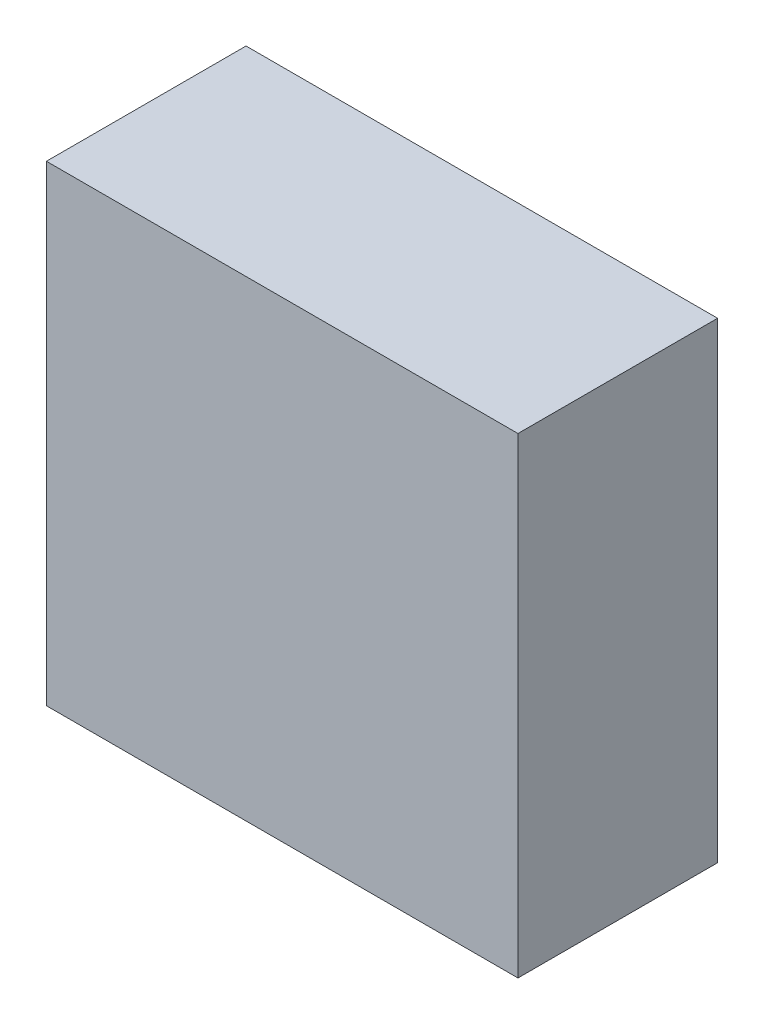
ISO-10303-21;
HEADER;
FILE_DESCRIPTION(('STEP AP214'),'2;1');
FILE_NAME('part.step','',(''),(''),'','','');
FILE_SCHEMA(('AUTOMOTIVE_DESIGN { 1 0 10303 214 1 1 1 1 }'));
ENDSEC;
DATA;
#1=APPLICATION_CONTEXT('core data for automotive mechanical design processes');
#2=APPLICATION_PROTOCOL_DEFINITION('international standard','automotive_design',2000,#1);
#3=PRODUCT_CONTEXT('',#1,'mechanical');
#4=PRODUCT('Part','Part','',(#3));
#5=PRODUCT_RELATED_PRODUCT_CATEGORY('part','',(#4));
#6=PRODUCT_DEFINITION_FORMATION('','',#4);
#7=PRODUCT_DEFINITION_CONTEXT('part definition',#1,'design');
#8=PRODUCT_DEFINITION('design','',#6,#7);
#9=PRODUCT_DEFINITION_SHAPE('','',#8);
#10=(LENGTH_UNIT() NAMED_UNIT(*) SI_UNIT(.MILLI.,.METRE.));
#11=(NAMED_UNIT(*) PLANE_ANGLE_UNIT() SI_UNIT($,.RADIAN.));
#12=(NAMED_UNIT(*) SI_UNIT($,.STERADIAN.) SOLID_ANGLE_UNIT());
#13=UNCERTAINTY_MEASURE_WITH_UNIT(LENGTH_MEASURE(1.E-05),#10,'distance_accuracy_value','');
#14=(GEOMETRIC_REPRESENTATION_CONTEXT(3) GLOBAL_UNCERTAINTY_ASSIGNED_CONTEXT((#13)) GLOBAL_UNIT_ASSIGNED_CONTEXT((#10,
#11,#12)) REPRESENTATION_CONTEXT('',''));
#15=CARTESIAN_POINT('',(0.,0.,0.));
#16=DIRECTION('',(0.,0.,1.));
#17=DIRECTION('',(1.,0.,0.));
#18=AXIS2_PLACEMENT_3D('',#15,#16,#17);
#19=CARTESIAN_POINT('',(0.,0.,50.8));
#20=DIRECTION('',(1.,0.,0.));
#21=DIRECTION('',(0.,1.,0.));
#22=AXIS2_PLACEMENT_3D('',#19,#20,#21);
#23=PLANE('',#22);
#24=DIRECTION('',(0.,-1.,0.));
#25=VECTOR('',#24,1.);
#26=CARTESIAN_POINT('',(0.,0.,0.));
#27=LINE('',#26,#25);
#28=CARTESIAN_POINT('',(0.,120.,0.));
#29=VERTEX_POINT('',#28);
#30=CARTESIAN_POINT('',(0.,0.,0.));
#31=VERTEX_POINT('',#30);
#32=EDGE_CURVE('E94',#29,#31,#27,.T.);
#33=ORIENTED_EDGE('',*,*,#32,.T.);
#34=DIRECTION('',(0.,0.,-1.));
#35=VECTOR('',#34,1.);
#36=CARTESIAN_POINT('',(0.,0.,50.8));
#37=LINE('',#36,#35);
#38=CARTESIAN_POINT('',(0.,0.,50.8));
#39=VERTEX_POINT('',#38);
#40=EDGE_CURVE('E11',#39,#31,#37,.T.);
#41=ORIENTED_EDGE('',*,*,#40,.F.);
#42=DIRECTION('',(0.,-1.,0.));
#43=VECTOR('',#42,1.);
#44=CARTESIAN_POINT('',(0.,0.,50.8));
#45=LINE('',#44,#43);
#46=CARTESIAN_POINT('',(0.,120.,50.8));
#47=VERTEX_POINT('',#46);
#48=EDGE_CURVE('E82',#47,#39,#45,.T.);
#49=ORIENTED_EDGE('',*,*,#48,.F.);
#50=DIRECTION('',(0.,0.,-1.));
#51=VECTOR('',#50,1.);
#52=CARTESIAN_POINT('',(0.,120.,50.8));
#53=LINE('',#52,#51);
#54=EDGE_CURVE('E90',#47,#29,#53,.T.);
#55=ORIENTED_EDGE('',*,*,#54,.T.);
#56=EDGE_LOOP('',(#33,#41,#49,#55));
#57=FACE_BOUND('',#56,.T.);
#58=ADVANCED_FACE('F31',(#57),#23,.F.);
#59=CARTESIAN_POINT('',(0.,0.,50.8));
#60=DIRECTION('',(0.,1.,0.));
#61=DIRECTION('',(0.,0.,1.));
#62=AXIS2_PLACEMENT_3D('',#59,#60,#61);
#63=PLANE('',#62);
#64=DIRECTION('',(1.,0.,0.));
#65=VECTOR('',#64,1.);
#66=CARTESIAN_POINT('',(0.,0.,0.));
#67=LINE('',#66,#65);
#68=CARTESIAN_POINT('',(120.,0.,0.));
#69=VERTEX_POINT('',#68);
#70=EDGE_CURVE('E86',#31,#69,#67,.T.);
#71=ORIENTED_EDGE('',*,*,#70,.T.);
#72=DIRECTION('',(0.,0.,-1.));
#73=VECTOR('',#72,1.);
#74=CARTESIAN_POINT('',(120.,0.,50.8));
#75=LINE('',#74,#73);
#76=CARTESIAN_POINT('',(120.,0.,50.8));
#77=VERTEX_POINT('',#76);
#78=EDGE_CURVE('E39',#77,#69,#75,.T.);
#79=ORIENTED_EDGE('',*,*,#78,.F.);
#80=DIRECTION('',(1.,0.,0.));
#81=VECTOR('',#80,1.);
#82=CARTESIAN_POINT('',(0.,0.,50.8));
#83=LINE('',#82,#81);
#84=EDGE_CURVE('E77',#39,#77,#83,.T.);
#85=ORIENTED_EDGE('',*,*,#84,.F.);
#86=ORIENTED_EDGE('',*,*,#40,.T.);
#87=EDGE_LOOP('',(#71,#79,#85,#86));
#88=FACE_BOUND('',#87,.T.);
#89=ADVANCED_FACE('F85',(#88),#63,.F.);
#90=CARTESIAN_POINT('',(120.,0.,50.8));
#91=DIRECTION('',(-1.,0.,0.));
#92=DIRECTION('',(0.,-1.,0.));
#93=AXIS2_PLACEMENT_3D('',#90,#91,#92);
#94=PLANE('',#93);
#95=DIRECTION('',(0.,1.,0.));
#96=VECTOR('',#95,1.);
#97=CARTESIAN_POINT('',(120.,0.,0.));
#98=LINE('',#97,#96);
#99=CARTESIAN_POINT('',(120.,120.,0.));
#100=VERTEX_POINT('',#99);
#101=EDGE_CURVE('E64',#69,#100,#98,.T.);
#102=ORIENTED_EDGE('',*,*,#101,.T.);
#103=DIRECTION('',(0.,0.,-1.));
#104=VECTOR('',#103,1.);
#105=CARTESIAN_POINT('',(120.,120.,50.8));
#106=LINE('',#105,#104);
#107=CARTESIAN_POINT('',(120.,120.,50.8));
#108=VERTEX_POINT('',#107);
#109=EDGE_CURVE('E87',#108,#100,#106,.T.);
#110=ORIENTED_EDGE('',*,*,#109,.F.);
#111=DIRECTION('',(0.,1.,0.));
#112=VECTOR('',#111,1.);
#113=CARTESIAN_POINT('',(120.,0.,50.8));
#114=LINE('',#113,#112);
#115=EDGE_CURVE('E80',#77,#108,#114,.T.);
#116=ORIENTED_EDGE('',*,*,#115,.F.);
#117=ORIENTED_EDGE('',*,*,#78,.T.);
#118=EDGE_LOOP('',(#102,#110,#116,#117));
#119=FACE_BOUND('',#118,.T.);
#120=ADVANCED_FACE('F88',(#119),#94,.F.);
#121=CARTESIAN_POINT('',(0.,120.,50.8));
#122=DIRECTION('',(0.,-1.,0.));
#123=DIRECTION('',(0.,0.,-1.));
#124=AXIS2_PLACEMENT_3D('',#121,#122,#123);
#125=PLANE('',#124);
#126=DIRECTION('',(-1.,0.,0.));
#127=VECTOR('',#126,1.);
#128=CARTESIAN_POINT('',(0.,120.,0.));
#129=LINE('',#128,#127);
#130=EDGE_CURVE('E70',#100,#29,#129,.T.);
#131=ORIENTED_EDGE('',*,*,#130,.T.);
#132=ORIENTED_EDGE('',*,*,#54,.F.);
#133=DIRECTION('',(-1.,0.,0.));
#134=VECTOR('',#133,1.);
#135=CARTESIAN_POINT('',(0.,120.,50.8));
#136=LINE('',#135,#134);
#137=EDGE_CURVE('E47',#108,#47,#136,.T.);
#138=ORIENTED_EDGE('',*,*,#137,.F.);
#139=ORIENTED_EDGE('',*,*,#109,.T.);
#140=EDGE_LOOP('',(#131,#132,#138,#139));
#141=FACE_BOUND('',#140,.T.);
#142=ADVANCED_FACE('F101',(#141),#125,.F.);
#143=CARTESIAN_POINT('',(0.,120.,50.8));
#144=DIRECTION('',(0.,0.,-1.));
#145=DIRECTION('',(-1.,0.,0.));
#146=AXIS2_PLACEMENT_3D('',#143,#144,#145);
#147=PLANE('',#146);
#148=ORIENTED_EDGE('',*,*,#48,.T.);
#149=ORIENTED_EDGE('',*,*,#84,.T.);
#150=ORIENTED_EDGE('',*,*,#115,.T.);
#151=ORIENTED_EDGE('',*,*,#137,.T.);
#152=EDGE_LOOP('',(#148,#149,#150,#151));
#153=FACE_BOUND('',#152,.T.);
#154=ADVANCED_FACE('F78',(#153),#147,.F.);
#155=CARTESIAN_POINT('',(0.,120.,0.));
#156=DIRECTION('',(0.,0.,-1.));
#157=DIRECTION('',(-1.,0.,0.));
#158=AXIS2_PLACEMENT_3D('',#155,#156,#157);
#159=PLANE('',#158);
#160=ORIENTED_EDGE('',*,*,#32,.F.);
#161=ORIENTED_EDGE('',*,*,#130,.F.);
#162=ORIENTED_EDGE('',*,*,#101,.F.);
#163=ORIENTED_EDGE('',*,*,#70,.F.);
#164=EDGE_LOOP('',(#160,#161,#162,#163));
#165=FACE_BOUND('',#164,.T.);
#166=ADVANCED_FACE('F104',(#165),#159,.T.);
#167=CLOSED_SHELL('',(#58,#89,#120,#142,#154,#166));
#168=MANIFOLD_SOLID_BREP('B2',#167);
#169=ADVANCED_BREP_SHAPE_REPRESENTATION('',(#18,#168),#14);
#170=SHAPE_DEFINITION_REPRESENTATION(#9,#169);
ENDSEC;
END-ISO-10303-21;
